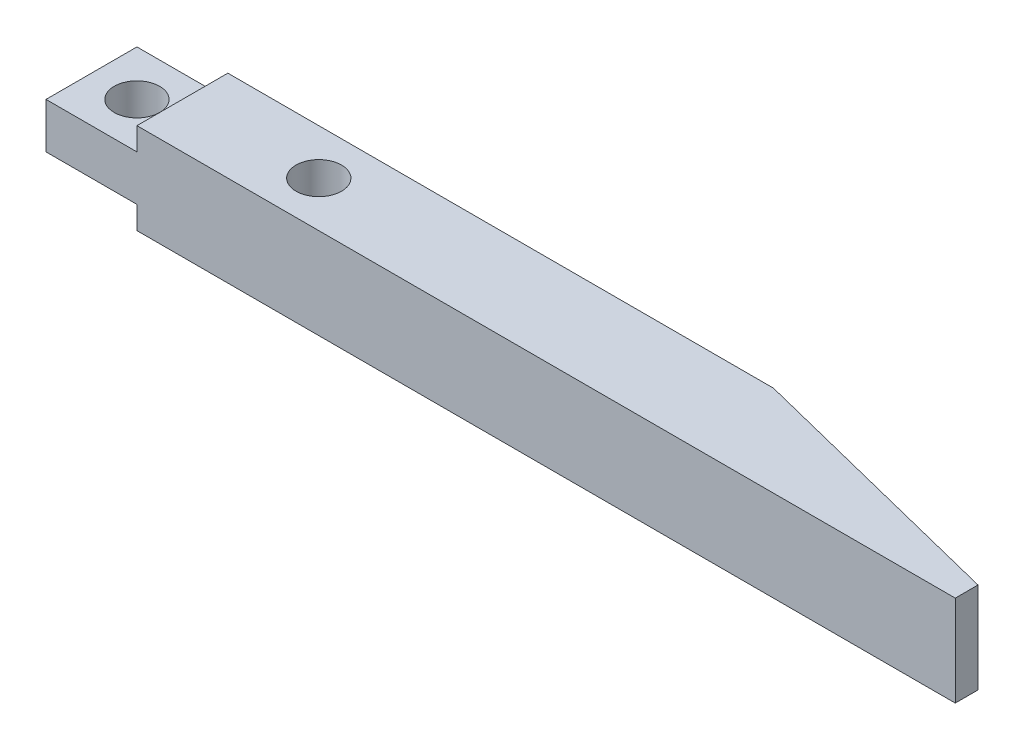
from build123d import *

# Parameters (mm, degrees)
SKETCH1_R           = 3.175
BOSS_EXTRUDE1_DEPTH = 12.7
SKETCH3_W           = 12.7
SKETCH3_H           = 3.175
CUT_EXTRUDE2_DEPTH  = 12.7


with BuildPart() as part:
    # Sketch1 → Boss-Extrude1 (new body)
    with BuildSketch(Plane(origin=(0, 0, 0), x_dir=(1, 0, 0), z_dir=(0, 1, 0))):
        Polygon((-1.012759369, -6.35), (95.25, -6.35), (95.25, -3.175), (57.15, 6.35), (-31.75, 6.35), (-31.75, -6.35), align=None)
        with Locations(Location((0, 0, 0), (0, 0, 270))):
            Circle(SKETCH1_R, mode=Mode.SUBTRACT)
        with Locations(Location((-25.4, 0, 0), (0, 0, 270))):
            Circle(SKETCH1_R, mode=Mode.SUBTRACT)
    extrude(amount=BOSS_EXTRUDE1_DEPTH)

    # Sketch3 → Cut-Extrude2 (cut)
    with BuildSketch(Plane.XY.offset(6.35)):
        with Locations((-25.4, 11.1125)):
            Rectangle(SKETCH3_W, SKETCH3_H)
        with Locations((-25.4, 1.5875)):
            Rectangle(SKETCH3_W, SKETCH3_H)
    extrude(amount=-CUT_EXTRUDE2_DEPTH, mode=Mode.SUBTRACT)


solid = part.part
